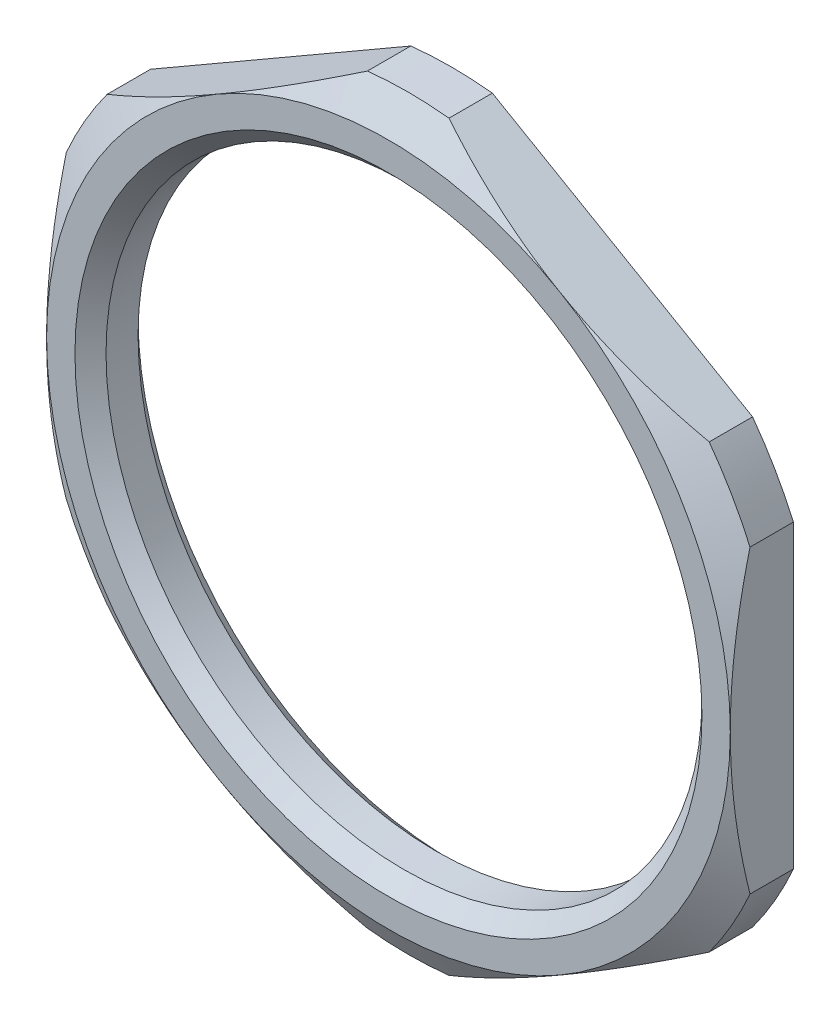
ISO-10303-21;
HEADER;
FILE_DESCRIPTION(('STEP AP214'),'2;1');
FILE_NAME('part.step','',(''),(''),'','','');
FILE_SCHEMA(('AUTOMOTIVE_DESIGN { 1 0 10303 214 1 1 1 1 }'));
ENDSEC;
DATA;
#1=APPLICATION_CONTEXT('core data for automotive mechanical design processes');
#2=APPLICATION_PROTOCOL_DEFINITION('international standard','automotive_design',2000,#1);
#3=PRODUCT_CONTEXT('',#1,'mechanical');
#4=PRODUCT('Part','Part','',(#3));
#5=PRODUCT_RELATED_PRODUCT_CATEGORY('part','',(#4));
#6=PRODUCT_DEFINITION_FORMATION('','',#4);
#7=PRODUCT_DEFINITION_CONTEXT('part definition',#1,'design');
#8=PRODUCT_DEFINITION('design','',#6,#7);
#9=PRODUCT_DEFINITION_SHAPE('','',#8);
#10=(LENGTH_UNIT() NAMED_UNIT(*) SI_UNIT(.MILLI.,.METRE.));
#11=(NAMED_UNIT(*) PLANE_ANGLE_UNIT() SI_UNIT($,.RADIAN.));
#12=(NAMED_UNIT(*) SI_UNIT($,.STERADIAN.) SOLID_ANGLE_UNIT());
#13=UNCERTAINTY_MEASURE_WITH_UNIT(LENGTH_MEASURE(1.E-05),#10,'distance_accuracy_value','');
#14=(GEOMETRIC_REPRESENTATION_CONTEXT(3) GLOBAL_UNCERTAINTY_ASSIGNED_CONTEXT((#13)) GLOBAL_UNIT_ASSIGNED_CONTEXT((#10,
#11,#12)) REPRESENTATION_CONTEXT('',''));
#15=CARTESIAN_POINT('',(0.,0.,0.));
#16=DIRECTION('',(0.,0.,1.));
#17=DIRECTION('',(1.,0.,0.));
#18=AXIS2_PLACEMENT_3D('',#15,#16,#17);
#19=CARTESIAN_POINT('',(0.,29.805,0.));
#20=DIRECTION('',(0.,0.,-1.));
#21=DIRECTION('',(-1.,0.,0.));
#22=AXIS2_PLACEMENT_3D('',#19,#20,#21);
#23=PLANE('',#22);
#24=DIRECTION('',(-0.866025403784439,-0.5,0.));
#25=VECTOR('',#24,1.);
#26=CARTESIAN_POINT('',(-3.3440564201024,35.5970756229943,0.));
#27=LINE('',#26,#25);
#28=CARTESIAN_POINT('',(-3.88068312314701,35.2872540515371,0.));
#29=VERTEX_POINT('',#28);
#30=CARTESIAN_POINT('',(-28.619316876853,21.0043971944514,0.));
#31=VERTEX_POINT('',#30);
#32=EDGE_CURVE('E389',#29,#31,#27,.T.);
#33=ORIENTED_EDGE('',*,*,#32,.F.);
#34=CARTESIAN_POINT('',(0.,9.29811783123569E-13,0.));
#35=DIRECTION('',(0.,0.,-1.));
#36=DIRECTION('',(-1.,0.,0.));
#37=AXIS2_PLACEMENT_3D('',#34,#35,#36);
#38=CIRCLE('',#37,35.4999999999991);
#39=CARTESIAN_POINT('',(3.88068312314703,35.2872540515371,0.));
#40=VERTEX_POINT('',#39);
#41=EDGE_CURVE('E391',#40,#29,#38,.F.);
#42=ORIENTED_EDGE('',*,*,#41,.F.);
#43=DIRECTION('',(-0.866025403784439,0.5,0.));
#44=VECTOR('',#43,1.);
#45=CARTESIAN_POINT('',(3.34405642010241,35.5970756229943,0.));
#46=LINE('',#45,#44);
#47=CARTESIAN_POINT('',(28.619316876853,21.0043971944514,0.));
#48=VERTEX_POINT('',#47);
#49=EDGE_CURVE('E147',#48,#40,#46,.T.);
#50=ORIENTED_EDGE('',*,*,#49,.F.);
#51=CARTESIAN_POINT('',(1.3010426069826E-12,7.45931094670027E-13,0.));
#52=DIRECTION('',(0.,0.,-1.));
#53=DIRECTION('',(-1.,0.,0.));
#54=AXIS2_PLACEMENT_3D('',#51,#52,#53);
#55=CIRCLE('',#54,35.4999999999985);
#56=CARTESIAN_POINT('',(32.5,14.2828568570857,-1.13473143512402E-13));
#57=VERTEX_POINT('',#56);
#58=EDGE_CURVE('E140',#57,#48,#55,.F.);
#59=ORIENTED_EDGE('',*,*,#58,.F.);
#60=DIRECTION('',(0.,1.,0.));
#61=VECTOR('',#60,1.);
#62=CARTESIAN_POINT('',(32.5,29.805,-1.13473143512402E-13));
#63=LINE('',#62,#61);
#64=CARTESIAN_POINT('',(32.5,-14.2828568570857,-1.13473143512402E-13));
#65=VERTEX_POINT('',#64);
#66=EDGE_CURVE('E130',#65,#57,#63,.T.);
#67=ORIENTED_EDGE('',*,*,#66,.F.);
#68=CARTESIAN_POINT('',(2.91433543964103E-13,-1.7347234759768E-13,0.));
#69=DIRECTION('',(0.,0.,-1.));
#70=DIRECTION('',(-1.,0.,0.));
#71=AXIS2_PLACEMENT_3D('',#68,#69,#70);
#72=CIRCLE('',#71,35.5);
#73=CARTESIAN_POINT('',(28.619316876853,-21.0043971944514,0.));
#74=VERTEX_POINT('',#73);
#75=EDGE_CURVE('E119',#74,#65,#72,.F.);
#76=ORIENTED_EDGE('',*,*,#75,.F.);
#77=DIRECTION('',(0.866025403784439,0.5,0.));
#78=VECTOR('',#77,1.);
#79=CARTESIAN_POINT('',(29.1559435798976,-20.6945756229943,-1.01797432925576E-13));
#80=LINE('',#79,#78);
#81=CARTESIAN_POINT('',(3.88068312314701,-35.2872540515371,0.));
#82=VERTEX_POINT('',#81);
#83=EDGE_CURVE('E124',#82,#74,#80,.T.);
#84=ORIENTED_EDGE('',*,*,#83,.F.);
#85=CARTESIAN_POINT('',(0.,-3.19189119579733E-13,0.));
#86=DIRECTION('',(0.,0.,-1.));
#87=DIRECTION('',(-1.,0.,0.));
#88=AXIS2_PLACEMENT_3D('',#85,#86,#87);
#89=CIRCLE('',#88,35.5);
#90=CARTESIAN_POINT('',(-3.88068312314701,-35.2872540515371,0.));
#91=VERTEX_POINT('',#90);
#92=EDGE_CURVE('E379',#91,#82,#89,.F.);
#93=ORIENTED_EDGE('',*,*,#92,.F.);
#94=DIRECTION('',(0.866025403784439,-0.5,0.));
#95=VECTOR('',#94,1.);
#96=CARTESIAN_POINT('',(-29.1559435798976,-20.6945756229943,1.01797432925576E-13));
#97=LINE('',#96,#95);
#98=CARTESIAN_POINT('',(-28.619316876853,-21.0043971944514,0.));
#99=VERTEX_POINT('',#98);
#100=EDGE_CURVE('E381',#99,#91,#97,.T.);
#101=ORIENTED_EDGE('',*,*,#100,.F.);
#102=CARTESIAN_POINT('',(8.11850586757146E-13,4.68375338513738E-13,0.));
#103=DIRECTION('',(0.,0.,-1.));
#104=DIRECTION('',(-1.,0.,0.));
#105=AXIS2_PLACEMENT_3D('',#102,#103,#104);
#106=CIRCLE('',#105,35.5000000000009);
#107=CARTESIAN_POINT('',(-32.5,-14.2828568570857,1.13473143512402E-13));
#108=VERTEX_POINT('',#107);
#109=EDGE_CURVE('E383',#108,#99,#106,.F.);
#110=ORIENTED_EDGE('',*,*,#109,.F.);
#111=DIRECTION('',(0.,-1.,0.));
#112=VECTOR('',#111,1.);
#113=CARTESIAN_POINT('',(-32.5,29.805,1.13473143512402E-13));
#114=LINE('',#113,#112);
#115=CARTESIAN_POINT('',(-32.5,14.2828568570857,1.13473143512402E-13));
#116=VERTEX_POINT('',#115);
#117=EDGE_CURVE('E385',#116,#108,#114,.T.);
#118=ORIENTED_EDGE('',*,*,#117,.F.);
#119=CARTESIAN_POINT('',(0.,0.,0.));
#120=DIRECTION('',(0.,0.,-1.));
#121=DIRECTION('',(-1.,0.,0.));
#122=AXIS2_PLACEMENT_3D('',#119,#120,#121);
#123=CIRCLE('',#122,35.5);
#124=EDGE_CURVE('E387',#31,#116,#123,.F.);
#125=ORIENTED_EDGE('',*,*,#124,.F.);
#126=EDGE_LOOP('',(#33,#42,#50,#59,#67,#76,#84,#93,#101,#110,#118,#125));
#127=FACE_BOUND('',#126,.T.);
#128=CARTESIAN_POINT('',(0.,0.,0.));
#129=DIRECTION('',(0.,0.,-1.));
#130=DIRECTION('',(-1.,0.,0.));
#131=AXIS2_PLACEMENT_3D('',#128,#129,#130);
#132=CIRCLE('',#131,29.805);
#133=CARTESIAN_POINT('',(-29.805,0.,1.0406360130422E-13));
#134=VERTEX_POINT('',#133);
#135=EDGE_CURVE('E152',#134,#134,#132,.T.);
#136=ORIENTED_EDGE('',*,*,#135,.F.);
#137=EDGE_LOOP('',(#136));
#138=FACE_BOUND('',#137,.T.);
#139=ADVANCED_FACE('F14',(#127,#138),#23,.T.);
#140=CARTESIAN_POINT('',(0.,0.,0.));
#141=DIRECTION('',(0.,0.,-1.));
#142=DIRECTION('',(-1.,0.,0.));
#143=AXIS2_PLACEMENT_3D('',#140,#141,#142);
#144=CONICAL_SURFACE('',#143,42.1020071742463,1.01229096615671);
#145=CARTESIAN_POINT('',(0.,0.,4.12539194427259));
#146=DIRECTION('',(0.,0.,-1.));
#147=DIRECTION('',(-1.,0.,0.));
#148=AXIS2_PLACEMENT_3D('',#145,#146,#147);
#149=CIRCLE('',#148,35.4999999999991);
#150=CARTESIAN_POINT('',(-3.880683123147,35.2872540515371,4.12539194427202));
#151=VERTEX_POINT('',#150);
#152=CARTESIAN_POINT('',(3.88068312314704,35.2872540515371,4.12539194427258));
#153=VERTEX_POINT('',#152);
#154=EDGE_CURVE('E18',#151,#153,#149,.T.);
#155=ORIENTED_EDGE('',*,*,#154,.F.);
#156=CARTESIAN_POINT('',(-28.619516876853,21.0042817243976,4.12533388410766));
#157=CARTESIAN_POINT('',(-27.9278554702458,21.4036126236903,4.32615335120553));
#158=CARTESIAN_POINT('',(-27.2331969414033,21.8046739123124,4.51367629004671));
#159=CARTESIAN_POINT('',(-25.8381436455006,22.6101083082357,4.85916322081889));
#160=CARTESIAN_POINT('',(-25.1377469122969,23.0144825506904,5.01711659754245));
#161=CARTESIAN_POINT('',(-23.7311787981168,23.8265650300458,5.30050999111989));
#162=CARTESIAN_POINT('',(-23.0250017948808,24.2342765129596,5.42591313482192));
#163=CARTESIAN_POINT('',(-21.6086649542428,25.0519989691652,5.64124098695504));
#164=CARTESIAN_POINT('',(-20.8985056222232,25.4620096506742,5.73117009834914));
#165=CARTESIAN_POINT('',(-19.4909667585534,26.2746525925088,5.87185625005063));
#166=CARTESIAN_POINT('',(-18.793648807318,26.6772492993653,5.92342967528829));
#167=CARTESIAN_POINT('',(-17.397650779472,27.4832291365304,5.98933807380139));
#168=CARTESIAN_POINT('',(-16.6989706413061,27.886612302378,6.00367132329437));
#169=CARTESIAN_POINT('',(-15.3023942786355,28.6929260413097,5.99473521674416));
#170=CARTESIAN_POINT('',(-14.6044978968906,29.0958567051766,5.97149820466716));
#171=CARTESIAN_POINT('',(-13.2104390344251,29.9007169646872,5.88807003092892));
#172=CARTESIAN_POINT('',(-12.5142763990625,30.3026466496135,5.82788229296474));
#173=CARTESIAN_POINT('',(-11.1538261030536,31.0881029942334,5.6752510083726));
#174=CARTESIAN_POINT('',(-10.4894157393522,31.4717004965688,5.58425137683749));
#175=CARTESIAN_POINT('',(-9.1643020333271,32.2367552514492,5.37152766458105));
#176=CARTESIAN_POINT('',(-8.50359874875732,32.6182124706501,5.24980310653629));
#177=CARTESIAN_POINT('',(-7.17943871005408,33.3827166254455,4.97642159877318));
#178=CARTESIAN_POINT('',(-6.51603071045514,33.7657354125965,4.82445221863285));
#179=CARTESIAN_POINT('',(-5.1943495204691,34.5288084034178,4.49407539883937));
#180=CARTESIAN_POINT('',(-4.53607496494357,34.9088633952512,4.31567525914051));
#181=CARTESIAN_POINT('',(-3.88048312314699,35.2873695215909,4.12533388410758));
#182=B_SPLINE_CURVE_WITH_KNOTS('',3,(#156,#157,#158,#159,#160,#161,#162,#163,#164,#165,#166,
#167,#168,#169,#170,#171,#172,#173,#174,#175,#176,#177,#178,#179,#180,#181),.UNSPECIFIED.,.F.,
.F.,(4,2,2,2,2,2,2,2,2,2,2,2,4),(0.,2.47062282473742,4.94213088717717,7.41642659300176,
9.8904150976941,12.3101075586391,14.7299120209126,17.1476344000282,19.5651327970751,
21.8821985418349,24.1993002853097,26.5417119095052,28.8834777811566),.UNSPECIFIED.);
#183=CARTESIAN_POINT('',(-16.25,28.1458256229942,6.));
#184=VERTEX_POINT('',#183);
#185=EDGE_CURVE('E9',#184,#151,#182,.T.);
#186=ORIENTED_EDGE('',*,*,#185,.F.);
#187=CARTESIAN_POINT('',(0.,0.,6.));
#188=DIRECTION('',(0.,0.,-1.));
#189=DIRECTION('',(-1.,0.,0.));
#190=AXIS2_PLACEMENT_3D('',#187,#188,#189);
#191=CIRCLE('',#190,32.5);
#192=CARTESIAN_POINT('',(16.25,28.1458256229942,6.));
#193=VERTEX_POINT('',#192);
#194=EDGE_CURVE('E146',#184,#193,#191,.T.);
#195=ORIENTED_EDGE('',*,*,#194,.T.);
#196=CARTESIAN_POINT('',(3.88048312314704,35.2873695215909,4.12533388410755));
#197=CARTESIAN_POINT('',(4.57214452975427,34.8880386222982,4.32615335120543));
#198=CARTESIAN_POINT('',(5.26680305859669,34.4869773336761,4.51367629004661));
#199=CARTESIAN_POINT('',(6.6618563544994,33.6815429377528,4.8591632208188));
#200=CARTESIAN_POINT('',(7.36225308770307,33.2771686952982,5.01711659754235));
#201=CARTESIAN_POINT('',(8.76882120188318,32.4650862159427,5.3005099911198));
#202=CARTESIAN_POINT('',(9.47499820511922,32.0573747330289,5.42591313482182));
#203=CARTESIAN_POINT('',(10.8913350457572,31.2396522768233,5.64124098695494));
#204=CARTESIAN_POINT('',(11.6014943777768,30.8296415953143,5.73117009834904));
#205=CARTESIAN_POINT('',(13.0090332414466,30.0169986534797,5.87185625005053));
#206=CARTESIAN_POINT('',(13.706351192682,29.6144019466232,5.92342967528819));
#207=CARTESIAN_POINT('',(15.102349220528,28.8084221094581,5.98933807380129));
#208=CARTESIAN_POINT('',(15.8010293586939,28.4050389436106,6.00367132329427));
#209=CARTESIAN_POINT('',(17.1976057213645,27.5987252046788,5.99473521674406));
#210=CARTESIAN_POINT('',(17.8955021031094,27.1957945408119,5.97149820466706));
#211=CARTESIAN_POINT('',(19.2895609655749,26.3909342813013,5.88807003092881));
#212=CARTESIAN_POINT('',(19.9857236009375,25.989004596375,5.82788229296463));
#213=CARTESIAN_POINT('',(21.3461738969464,25.2035482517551,5.67525100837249));
#214=CARTESIAN_POINT('',(22.0105842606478,24.8199507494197,5.58425137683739));
#215=CARTESIAN_POINT('',(23.3356979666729,24.0548959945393,5.37152766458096));
#216=CARTESIAN_POINT('',(23.9964012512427,23.6734387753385,5.24980310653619));
#217=CARTESIAN_POINT('',(25.3205612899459,22.908934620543,4.97642159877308));
#218=CARTESIAN_POINT('',(25.9839692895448,22.525915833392,4.82445221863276));
#219=CARTESIAN_POINT('',(27.3056504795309,21.7628428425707,4.49407539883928));
#220=CARTESIAN_POINT('',(27.9639250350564,21.3827878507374,4.31567525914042));
#221=CARTESIAN_POINT('',(28.619516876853,21.0042817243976,4.12533388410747));
#222=B_SPLINE_CURVE_WITH_KNOTS('',3,(#196,#197,#198,#199,#200,#201,#202,#203,#204,#205,#206,
#207,#208,#209,#210,#211,#212,#213,#214,#215,#216,#217,#218,#219,#220,#221),.UNSPECIFIED.,.F.,
.F.,(4,2,2,2,2,2,2,2,2,2,2,2,4),(0.,2.47062282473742,4.94213088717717,7.41642659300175,
9.89041509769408,12.3101075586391,14.7299120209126,17.1476344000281,19.565132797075,
21.8821985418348,24.1993002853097,26.5417119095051,28.8834777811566),.UNSPECIFIED.);
#223=EDGE_CURVE('E252',#153,#193,#222,.T.);
#224=ORIENTED_EDGE('',*,*,#223,.F.);
#225=EDGE_LOOP('',(#155,#186,#195,#224));
#226=FACE_BOUND('',#225,.T.);
#227=ADVANCED_FACE('F199',(#226),#144,.T.);
#228=CARTESIAN_POINT('',(-28.619316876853,21.0043971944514,4.12539194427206));
#229=VERTEX_POINT('',#228);
#230=EDGE_CURVE('E23',#229,#184,#182,.T.);
#231=ORIENTED_EDGE('',*,*,#230,.F.);
#232=CARTESIAN_POINT('',(0.,0.,4.12539194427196));
#233=DIRECTION('',(0.,0.,-1.));
#234=DIRECTION('',(-1.,0.,0.));
#235=AXIS2_PLACEMENT_3D('',#232,#233,#234);
#236=CIRCLE('',#235,35.5);
#237=CARTESIAN_POINT('',(-32.5,14.2828568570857,4.12539194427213));
#238=VERTEX_POINT('',#237);
#239=EDGE_CURVE('E246',#238,#229,#236,.T.);
#240=ORIENTED_EDGE('',*,*,#239,.F.);
#241=CARTESIAN_POINT('',(-32.5,-43.4720958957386,-7.60824263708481));
#242=CARTESIAN_POINT('',(-32.5,-42.9179423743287,-7.33090970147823));
#243=CARTESIAN_POINT('',(-32.5,-42.3630320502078,-7.05509005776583));
#244=CARTESIAN_POINT('',(-32.5,-41.2515709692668,-6.50676263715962));
#245=CARTESIAN_POINT('',(-32.5,-40.6950201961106,-6.23425489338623));
#246=CARTESIAN_POINT('',(-32.5,-39.022599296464,-5.42207049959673));
#247=CARTESIAN_POINT('',(-32.5,-37.9040940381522,-4.88779964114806));
#248=CARTESIAN_POINT('',(-32.5,-35.6552825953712,-3.83476595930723));
#249=CARTESIAN_POINT('',(-32.5,-34.5249496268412,-3.31606022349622));
#250=CARTESIAN_POINT('',(-32.5,-32.2549221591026,-2.29959410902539));
#251=CARTESIAN_POINT('',(-32.5,-31.1152279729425,-1.80183303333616));
#252=CARTESIAN_POINT('',(-32.5,-28.7905019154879,-0.817055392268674));
#253=CARTESIAN_POINT('',(-32.5,-27.6051395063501,-0.330815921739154));
#254=CARTESIAN_POINT('',(-32.5,-25.2212686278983,0.608670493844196));
#255=CARTESIAN_POINT('',(-32.5,-24.0227594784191,1.06191572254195));
#256=CARTESIAN_POINT('',(-32.5,-21.6123589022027,1.92735953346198));
#257=CARTESIAN_POINT('',(-32.5,-20.4004829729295,2.33960102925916));
#258=CARTESIAN_POINT('',(-32.5,-17.9609399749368,3.11438274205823));
#259=CARTESIAN_POINT('',(-32.5,-16.7332751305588,3.47692987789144));
#260=CARTESIAN_POINT('',(-32.5,-14.6812770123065,4.02881335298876));
#261=CARTESIAN_POINT('',(-32.5,-13.8615157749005,4.23516711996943));
#262=CARTESIAN_POINT('',(-32.5,-12.2150639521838,4.61822853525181));
#263=CARTESIAN_POINT('',(-32.5,-11.3883735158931,4.79493681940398));
#264=CARTESIAN_POINT('',(-32.5,-9.72871386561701,5.11536729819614));
#265=CARTESIAN_POINT('',(-32.5,-8.89574560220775,5.25909438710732));
#266=CARTESIAN_POINT('',(-32.5,-7.22434837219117,5.51048901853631));
#267=CARTESIAN_POINT('',(-32.5,-6.38591943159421,5.61815673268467));
#268=CARTESIAN_POINT('',(-32.5,-4.71579761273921,5.79368711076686));
#269=CARTESIAN_POINT('',(-32.5,-3.88415712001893,5.86204474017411));
#270=CARTESIAN_POINT('',(-32.5,-2.21856908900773,5.95933129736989));
#271=CARTESIAN_POINT('',(-32.5,-1.38462159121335,5.98826091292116));
#272=CARTESIAN_POINT('',(-32.4999999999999,0.283671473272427,6.00591336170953));
#273=CARTESIAN_POINT('',(-32.4999999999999,1.11801702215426,5.99463785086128));
#274=CARTESIAN_POINT('',(-32.5,2.78521915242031,5.93219695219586));
#275=CARTESIAN_POINT('',(-32.5,3.61807567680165,5.88103006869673));
#276=CARTESIAN_POINT('',(-32.5,5.48179563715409,5.72305886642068));
#277=CARTESIAN_POINT('',(-32.5,6.5117790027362,5.60578346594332));
#278=CARTESIAN_POINT('',(-32.4999999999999,8.56394542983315,5.31607415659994));
#279=CARTESIAN_POINT('',(-32.5,9.5861277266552,5.14363490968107));
#280=CARTESIAN_POINT('',(-32.5,11.6215574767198,4.7491432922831));
#281=CARTESIAN_POINT('',(-32.5,12.6347979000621,4.5270549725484));
#282=CARTESIAN_POINT('',(-32.5,14.6506893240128,4.03949718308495));
#283=CARTESIAN_POINT('',(-32.5,15.6533404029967,3.77402803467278));
#284=CARTESIAN_POINT('',(-32.5,17.6613691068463,3.20190208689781));
#285=CARTESIAN_POINT('',(-32.5,18.6666013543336,2.89473840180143));
#286=CARTESIAN_POINT('',(-32.5,20.6664507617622,2.24777954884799));
#287=CARTESIAN_POINT('',(-32.5,21.6610678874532,1.90798427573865));
#288=CARTESIAN_POINT('',(-32.5,23.6400850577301,1.20090738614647));
#289=CARTESIAN_POINT('',(-32.5,24.6244882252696,0.833634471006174));
#290=CARTESIAN_POINT('',(-32.5,26.5842527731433,0.0757929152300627));
#291=CARTESIAN_POINT('',(-32.5,27.5596141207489,-0.31477580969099));
#292=CARTESIAN_POINT('',(-32.5,29.8112288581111,-1.24297636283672));
#293=CARTESIAN_POINT('',(-32.5,31.0844868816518,-1.78786360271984));
#294=CARTESIAN_POINT('',(-32.5,33.6188500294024,-2.90511432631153));
#295=CARTESIAN_POINT('',(-32.5,34.8799549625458,-3.47747824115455));
#296=CARTESIAN_POINT('',(-32.5,37.3676481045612,-4.63327206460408));
#297=CARTESIAN_POINT('',(-32.5,38.5944338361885,-5.21627778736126));
#298=CARTESIAN_POINT('',(-32.5,40.4281603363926,-6.10396186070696));
#299=CARTESIAN_POINT('',(-32.5,41.038308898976,-6.40204330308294));
#300=CARTESIAN_POINT('',(-32.5,42.2566395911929,-7.00222547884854));
#301=CARTESIAN_POINT('',(-32.5,42.8648216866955,-7.30432628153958));
#302=CARTESIAN_POINT('',(-32.5,43.4720958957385,-7.60824263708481));
#303=B_SPLINE_CURVE_WITH_KNOTS('',3,(#241,#242,#243,#244,#245,#246,#247,#248,#249,#250,#251,
#252,#253,#254,#255,#256,#257,#258,#259,#260,#261,#262,#263,#264,#265,#266,#267,#268,#269,#270,
#271,#272,#273,#274,#275,#276,#277,#278,#279,#280,#281,#282,#283,#284,#285,#286,#287,#288,#289,
#290,#291,#292,#293,#294,#295,#296,#297,#298,#299,#300,#301,#302),.UNSPECIFIED.,.F.,.F.,(4,2,2,
2,2,2,2,2,2,2,2,2,2,2,2,2,2,2,2,2,2,2,2,2,2,2,2,2,2,2,4),(0.,1.85902691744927,3.71807241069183,
7.43661127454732,11.1674394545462,14.8981433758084,18.7413895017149,22.584835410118,
26.4242155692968,30.263060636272,32.7985986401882,35.3340822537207,37.8691893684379,
40.404284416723,42.9067180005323,45.4091079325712,47.9113948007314,50.4137754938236,
53.5220046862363,56.6305347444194,59.741322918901,62.8520880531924,66.0047785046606,
69.1574791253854,72.3091855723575,75.4609034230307,79.6153270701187,83.7698159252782,
87.8444477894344,89.8816411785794,91.9188697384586),.UNSPECIFIED.);
#304=CARTESIAN_POINT('',(-32.5,0.,6.00000000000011));
#305=VERTEX_POINT('',#304);
#306=EDGE_CURVE('E248',#305,#238,#303,.T.);
#307=ORIENTED_EDGE('',*,*,#306,.F.);
#308=EDGE_CURVE('E141',#305,#184,#191,.T.);
#309=ORIENTED_EDGE('',*,*,#308,.T.);
#310=EDGE_LOOP('',(#231,#240,#307,#309));
#311=FACE_BOUND('',#310,.T.);
#312=ADVANCED_FACE('F204',(#311),#144,.T.);
#313=CARTESIAN_POINT('',(28.619316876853,21.0043971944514,4.12539194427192));
#314=VERTEX_POINT('',#313);
#315=EDGE_CURVE('E256',#193,#314,#222,.T.);
#316=ORIENTED_EDGE('',*,*,#315,.F.);
#317=CARTESIAN_POINT('',(32.5,0.,5.99999999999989));
#318=VERTEX_POINT('',#317);
#319=EDGE_CURVE('E153',#193,#318,#191,.T.);
#320=ORIENTED_EDGE('',*,*,#319,.T.);
#321=CARTESIAN_POINT('',(32.5,43.4720958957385,-7.60824263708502));
#322=CARTESIAN_POINT('',(32.5,42.9179423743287,-7.33090970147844));
#323=CARTESIAN_POINT('',(32.5,42.3630320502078,-7.05509005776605));
#324=CARTESIAN_POINT('',(32.5,41.2515709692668,-6.50676263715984));
#325=CARTESIAN_POINT('',(32.5,40.6950201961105,-6.23425489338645));
#326=CARTESIAN_POINT('',(32.5,39.022599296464,-5.42207049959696));
#327=CARTESIAN_POINT('',(32.5,37.9040940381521,-4.88779964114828));
#328=CARTESIAN_POINT('',(32.5,35.6552825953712,-3.83476595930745));
#329=CARTESIAN_POINT('',(32.5,34.5249496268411,-3.31606022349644));
#330=CARTESIAN_POINT('',(32.5,32.2549221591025,-2.29959410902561));
#331=CARTESIAN_POINT('',(32.5,31.1152279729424,-1.80183303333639));
#332=CARTESIAN_POINT('',(32.5,28.7905019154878,-0.817055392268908));
#333=CARTESIAN_POINT('',(32.5,27.60513950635,-0.330815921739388));
#334=CARTESIAN_POINT('',(32.5,25.2212686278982,0.608670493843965));
#335=CARTESIAN_POINT('',(32.5,24.022759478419,1.06191572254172));
#336=CARTESIAN_POINT('',(32.5,21.6123589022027,1.92735953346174));
#337=CARTESIAN_POINT('',(32.5,20.4004829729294,2.33960102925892));
#338=CARTESIAN_POINT('',(32.5,17.9609399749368,3.11438274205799));
#339=CARTESIAN_POINT('',(32.5,16.7332751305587,3.47692987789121));
#340=CARTESIAN_POINT('',(32.5,14.6812770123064,4.02881335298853));
#341=CARTESIAN_POINT('',(32.5,13.8615157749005,4.23516711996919));
#342=CARTESIAN_POINT('',(32.5,12.2150639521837,4.61822853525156));
#343=CARTESIAN_POINT('',(32.5,11.388373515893,4.79493681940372));
#344=CARTESIAN_POINT('',(32.5,9.72871386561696,5.11536729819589));
#345=CARTESIAN_POINT('',(32.5,8.8957456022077,5.25909438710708));
#346=CARTESIAN_POINT('',(32.5,7.22434837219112,5.51048901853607));
#347=CARTESIAN_POINT('',(32.5,6.38591943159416,5.61815673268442));
#348=CARTESIAN_POINT('',(32.5,4.71579761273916,5.7936871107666));
#349=CARTESIAN_POINT('',(32.5,3.88415712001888,5.86204474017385));
#350=CARTESIAN_POINT('',(32.5,2.21856908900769,5.95933129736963));
#351=CARTESIAN_POINT('',(32.5,1.38462159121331,5.9882609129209));
#352=CARTESIAN_POINT('',(32.5000000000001,-0.283671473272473,6.00591336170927));
#353=CARTESIAN_POINT('',(32.5000000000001,-1.11801702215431,5.99463785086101));
#354=CARTESIAN_POINT('',(32.5,-2.78521915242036,5.93219695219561));
#355=CARTESIAN_POINT('',(32.5,-3.6180756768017,5.8810300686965));
#356=CARTESIAN_POINT('',(32.5,-5.48179563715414,5.72305886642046));
#357=CARTESIAN_POINT('',(32.5,-6.51177900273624,5.60578346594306));
#358=CARTESIAN_POINT('',(32.5000000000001,-8.56394542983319,5.31607415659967));
#359=CARTESIAN_POINT('',(32.5,-9.58612772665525,5.1436349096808));
#360=CARTESIAN_POINT('',(32.5,-11.6215574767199,4.74914329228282));
#361=CARTESIAN_POINT('',(32.5,-12.6347979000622,4.52705497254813));
#362=CARTESIAN_POINT('',(32.5,-14.6506893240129,4.03949718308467));
#363=CARTESIAN_POINT('',(32.5,-15.6533404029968,3.77402803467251));
#364=CARTESIAN_POINT('',(32.5,-17.6613691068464,3.20190208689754));
#365=CARTESIAN_POINT('',(32.5,-18.6666013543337,2.89473840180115));
#366=CARTESIAN_POINT('',(32.5,-20.6664507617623,2.24777954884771));
#367=CARTESIAN_POINT('',(32.5,-21.6610678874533,1.90798427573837));
#368=CARTESIAN_POINT('',(32.5,-23.6400850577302,1.20090738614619));
#369=CARTESIAN_POINT('',(32.5,-24.6244882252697,0.833634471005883));
#370=CARTESIAN_POINT('',(32.5,-26.5842527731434,0.0757929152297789));
#371=CARTESIAN_POINT('',(32.5,-27.559614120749,-0.314775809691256));
#372=CARTESIAN_POINT('',(32.5,-29.8112288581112,-1.24297636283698));
#373=CARTESIAN_POINT('',(32.5,-31.0844868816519,-1.78786360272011));
#374=CARTESIAN_POINT('',(32.5,-33.6188500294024,-2.90511432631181));
#375=CARTESIAN_POINT('',(32.5,-34.8799549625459,-3.47747824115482));
#376=CARTESIAN_POINT('',(32.5,-37.3676481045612,-4.63327206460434));
#377=CARTESIAN_POINT('',(32.5,-38.5944338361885,-5.21627778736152));
#378=CARTESIAN_POINT('',(32.5,-40.4281603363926,-6.10396186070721));
#379=CARTESIAN_POINT('',(32.5,-41.038308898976,-6.40204330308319));
#380=CARTESIAN_POINT('',(32.5,-42.2566395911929,-7.00222547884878));
#381=CARTESIAN_POINT('',(32.5,-42.8648216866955,-7.3043262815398));
#382=CARTESIAN_POINT('',(32.5,-43.4720958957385,-7.60824263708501));
#383=B_SPLINE_CURVE_WITH_KNOTS('',3,(#321,#322,#323,#324,#325,#326,#327,#328,#329,#330,#331,
#332,#333,#334,#335,#336,#337,#338,#339,#340,#341,#342,#343,#344,#345,#346,#347,#348,#349,#350,
#351,#352,#353,#354,#355,#356,#357,#358,#359,#360,#361,#362,#363,#364,#365,#366,#367,#368,#369,
#370,#371,#372,#373,#374,#375,#376,#377,#378,#379,#380,#381,#382),.UNSPECIFIED.,.F.,.F.,(4,2,2,
2,2,2,2,2,2,2,2,2,2,2,2,2,2,2,2,2,2,2,2,2,2,2,2,2,2,2,4),(0.,1.85902691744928,3.71807241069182,
7.43661127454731,11.1674394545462,14.8981433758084,18.7413895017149,22.584835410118,
26.4242155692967,30.263060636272,32.7985986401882,35.3340822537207,37.8691893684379,
40.404284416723,42.9067180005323,45.4091079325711,47.9113948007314,50.4137754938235,
53.5220046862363,56.6305347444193,59.741322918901,62.8520880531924,66.0047785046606,
69.1574791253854,72.3091855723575,75.4609034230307,79.6153270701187,83.7698159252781,
87.8444477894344,89.8816411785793,91.9188697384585),.UNSPECIFIED.);
#384=CARTESIAN_POINT('',(32.5,14.2828568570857,4.12539194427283));
#385=VERTEX_POINT('',#384);
#386=EDGE_CURVE('E354',#385,#318,#383,.T.);
#387=ORIENTED_EDGE('',*,*,#386,.F.);
#388=CARTESIAN_POINT('',(0.,0.,4.12539194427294));
#389=DIRECTION('',(0.,0.,-1.));
#390=DIRECTION('',(-1.,0.,0.));
#391=AXIS2_PLACEMENT_3D('',#388,#389,#390);
#392=CIRCLE('',#391,35.4999999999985);
#393=EDGE_CURVE('E272',#314,#385,#392,.T.);
#394=ORIENTED_EDGE('',*,*,#393,.F.);
#395=EDGE_LOOP('',(#316,#320,#387,#394));
#396=FACE_BOUND('',#395,.T.);
#397=ADVANCED_FACE('F334',(#396),#144,.T.);
#398=CARTESIAN_POINT('',(-32.5,-14.2828568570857,4.12539194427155));
#399=VERTEX_POINT('',#398);
#400=EDGE_CURVE('E254',#399,#305,#303,.T.);
#401=ORIENTED_EDGE('',*,*,#400,.F.);
#402=CARTESIAN_POINT('',(0.,0.,4.12539194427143));
#403=DIRECTION('',(0.,0.,-1.));
#404=DIRECTION('',(-1.,0.,0.));
#405=AXIS2_PLACEMENT_3D('',#402,#403,#404);
#406=CIRCLE('',#405,35.5000000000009);
#407=CARTESIAN_POINT('',(-28.619316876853,-21.0043971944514,4.12539194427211));
#408=VERTEX_POINT('',#407);
#409=EDGE_CURVE('E264',#408,#399,#406,.T.);
#410=ORIENTED_EDGE('',*,*,#409,.F.);
#411=CARTESIAN_POINT('',(-3.88048312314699,-35.2873695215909,4.12533388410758));
#412=CARTESIAN_POINT('',(-4.57214452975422,-34.8880386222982,4.32615335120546));
#413=CARTESIAN_POINT('',(-5.26680305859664,-34.4869773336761,4.51367629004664));
#414=CARTESIAN_POINT('',(-6.66185635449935,-33.6815429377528,4.85916322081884));
#415=CARTESIAN_POINT('',(-7.36225308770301,-33.2771686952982,5.0171165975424));
#416=CARTESIAN_POINT('',(-8.76882120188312,-32.4650862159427,5.30050999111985));
#417=CARTESIAN_POINT('',(-9.47499820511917,-32.0573747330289,5.42591313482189));
#418=CARTESIAN_POINT('',(-10.8913350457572,-31.2396522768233,5.64124098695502));
#419=CARTESIAN_POINT('',(-11.6014943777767,-30.8296415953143,5.73117009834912));
#420=CARTESIAN_POINT('',(-13.0090332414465,-30.0169986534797,5.87185625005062));
#421=CARTESIAN_POINT('',(-13.7063511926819,-29.6144019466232,5.92342967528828));
#422=CARTESIAN_POINT('',(-15.102349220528,-28.8084221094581,5.98933807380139));
#423=CARTESIAN_POINT('',(-15.8010293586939,-28.4050389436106,6.00367132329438));
#424=CARTESIAN_POINT('',(-17.1976057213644,-27.5987252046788,5.99473521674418));
#425=CARTESIAN_POINT('',(-17.8955021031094,-27.1957945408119,5.97149820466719));
#426=CARTESIAN_POINT('',(-19.2895609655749,-26.3909342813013,5.88807003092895));
#427=CARTESIAN_POINT('',(-19.9857236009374,-25.989004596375,5.82788229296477));
#428=CARTESIAN_POINT('',(-21.3461738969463,-25.2035482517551,5.67525100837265));
#429=CARTESIAN_POINT('',(-22.0105842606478,-24.8199507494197,5.58425137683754));
#430=CARTESIAN_POINT('',(-23.3356979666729,-24.0548959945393,5.37152766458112));
#431=CARTESIAN_POINT('',(-23.9964012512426,-23.6734387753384,5.24980310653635));
#432=CARTESIAN_POINT('',(-25.3205612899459,-22.908934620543,4.97642159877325));
#433=CARTESIAN_POINT('',(-25.9839692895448,-22.525915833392,4.82445221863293));
#434=CARTESIAN_POINT('',(-27.3056504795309,-21.7628428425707,4.49407539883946));
#435=CARTESIAN_POINT('',(-27.9639250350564,-21.3827878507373,4.3156752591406));
#436=CARTESIAN_POINT('',(-28.619516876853,-21.0042817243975,4.12533388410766));
#437=B_SPLINE_CURVE_WITH_KNOTS('',3,(#411,#412,#413,#414,#415,#416,#417,#418,#419,#420,#421,
#422,#423,#424,#425,#426,#427,#428,#429,#430,#431,#432,#433,#434,#435,#436),.UNSPECIFIED.,.F.,
.F.,(4,2,2,2,2,2,2,2,2,2,2,2,4),(0.,2.47062282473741,4.94213088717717,7.41642659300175,
9.89041509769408,12.3101075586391,14.7299120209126,17.1476344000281,19.565132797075,
21.8821985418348,24.1993002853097,26.5417119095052,28.8834777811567),.UNSPECIFIED.);
#438=CARTESIAN_POINT('',(-16.25,-28.1458256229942,6.));
#439=VERTEX_POINT('',#438);
#440=EDGE_CURVE('E267',#439,#408,#437,.T.);
#441=ORIENTED_EDGE('',*,*,#440,.F.);
#442=EDGE_CURVE('E144',#439,#305,#191,.T.);
#443=ORIENTED_EDGE('',*,*,#442,.T.);
#444=EDGE_LOOP('',(#401,#410,#441,#443));
#445=FACE_BOUND('',#444,.T.);
#446=ADVANCED_FACE('F328',(#445),#144,.T.);
#447=CARTESIAN_POINT('',(-3.880683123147,-35.2872540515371,4.12539194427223));
#448=VERTEX_POINT('',#447);
#449=EDGE_CURVE('E274',#448,#439,#437,.T.);
#450=ORIENTED_EDGE('',*,*,#449,.F.);
#451=CARTESIAN_POINT('',(0.,0.,4.12539194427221));
#452=DIRECTION('',(0.,0.,-1.));
#453=DIRECTION('',(-1.,0.,0.));
#454=AXIS2_PLACEMENT_3D('',#451,#452,#453);
#455=CIRCLE('',#454,35.5);
#456=CARTESIAN_POINT('',(3.88068312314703,-35.2872540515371,4.12539194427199));
#457=VERTEX_POINT('',#456);
#458=EDGE_CURVE('E280',#457,#448,#455,.T.);
#459=ORIENTED_EDGE('',*,*,#458,.F.);
#460=CARTESIAN_POINT('',(28.619516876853,-21.0042817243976,4.12533388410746));
#461=CARTESIAN_POINT('',(27.9278554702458,-21.4036126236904,4.32615335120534));
#462=CARTESIAN_POINT('',(27.2331969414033,-21.8046739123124,4.51367629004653));
#463=CARTESIAN_POINT('',(25.8381436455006,-22.6101083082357,4.85916322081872));
#464=CARTESIAN_POINT('',(25.137746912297,-23.0144825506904,5.01711659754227));
#465=CARTESIAN_POINT('',(23.7311787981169,-23.8265650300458,5.30050999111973));
#466=CARTESIAN_POINT('',(23.0250017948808,-24.2342765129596,5.42591313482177));
#467=CARTESIAN_POINT('',(21.6086649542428,-25.0519989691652,5.6412409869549));
#468=CARTESIAN_POINT('',(20.8985056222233,-25.4620096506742,5.731170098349));
#469=CARTESIAN_POINT('',(19.4909667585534,-26.2746525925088,5.8718562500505));
#470=CARTESIAN_POINT('',(18.7936488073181,-26.6772492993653,5.92342967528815));
#471=CARTESIAN_POINT('',(17.397650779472,-27.4832291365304,5.98933807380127));
#472=CARTESIAN_POINT('',(16.6989706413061,-27.886612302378,6.00367132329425));
#473=CARTESIAN_POINT('',(15.3023942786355,-28.6929260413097,5.99473521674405));
#474=CARTESIAN_POINT('',(14.6044978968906,-29.0958567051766,5.97149820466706));
#475=CARTESIAN_POINT('',(13.2104390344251,-29.9007169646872,5.88807003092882));
#476=CARTESIAN_POINT('',(12.5142763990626,-30.3026466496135,5.82788229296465));
#477=CARTESIAN_POINT('',(11.1538261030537,-31.0881029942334,5.67525100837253));
#478=CARTESIAN_POINT('',(10.4894157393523,-31.4717004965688,5.58425137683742));
#479=CARTESIAN_POINT('',(9.16430203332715,-32.2367552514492,5.37152766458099));
#480=CARTESIAN_POINT('',(8.50359874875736,-32.6182124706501,5.24980310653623));
#481=CARTESIAN_POINT('',(7.17943871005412,-33.3827166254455,4.97642159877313));
#482=CARTESIAN_POINT('',(6.51603071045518,-33.7657354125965,4.82445221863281));
#483=CARTESIAN_POINT('',(5.19434952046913,-34.5288084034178,4.49407539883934));
#484=CARTESIAN_POINT('',(4.53607496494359,-34.9088633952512,4.31567525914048));
#485=CARTESIAN_POINT('',(3.88048312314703,-35.2873695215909,4.12533388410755));
#486=B_SPLINE_CURVE_WITH_KNOTS('',3,(#460,#461,#462,#463,#464,#465,#466,#467,#468,#469,#470,
#471,#472,#473,#474,#475,#476,#477,#478,#479,#480,#481,#482,#483,#484,#485),.UNSPECIFIED.,.F.,
.F.,(4,2,2,2,2,2,2,2,2,2,2,2,4),(0.,2.47062282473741,4.94213088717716,7.41642659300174,
9.89041509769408,12.310107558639,14.7299120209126,17.1476344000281,19.565132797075,
21.8821985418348,24.1993002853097,26.5417119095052,28.8834777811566),.UNSPECIFIED.);
#487=CARTESIAN_POINT('',(16.25,-28.1458256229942,6.));
#488=VERTEX_POINT('',#487);
#489=EDGE_CURVE('E175',#488,#457,#486,.T.);
#490=ORIENTED_EDGE('',*,*,#489,.F.);
#491=EDGE_CURVE('E341',#488,#439,#191,.T.);
#492=ORIENTED_EDGE('',*,*,#491,.T.);
#493=EDGE_LOOP('',(#450,#459,#490,#492));
#494=FACE_BOUND('',#493,.T.);
#495=ADVANCED_FACE('F221',(#494),#144,.T.);
#496=CARTESIAN_POINT('',(0.,32.5,6.));
#497=DIRECTION('',(0.,0.,1.));
#498=DIRECTION('',(1.,0.,0.));
#499=AXIS2_PLACEMENT_3D('',#496,#497,#498);
#500=PLANE('',#499);
#501=CARTESIAN_POINT('',(0.,0.,6.));
#502=DIRECTION('',(0.,0.,-1.));
#503=DIRECTION('',(-1.,0.,0.));
#504=AXIS2_PLACEMENT_3D('',#501,#502,#503);
#505=CIRCLE('',#504,29.805);
#506=CARTESIAN_POINT('',(-29.805,0.,6.0000000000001));
#507=VERTEX_POINT('',#506);
#508=EDGE_CURVE('E162',#507,#507,#505,.T.);
#509=ORIENTED_EDGE('',*,*,#508,.T.);
#510=EDGE_LOOP('',(#509));
#511=FACE_BOUND('',#510,.T.);
#512=ORIENTED_EDGE('',*,*,#194,.F.);
#513=ORIENTED_EDGE('',*,*,#308,.F.);
#514=ORIENTED_EDGE('',*,*,#442,.F.);
#515=ORIENTED_EDGE('',*,*,#491,.F.);
#516=EDGE_CURVE('E348',#318,#488,#191,.T.);
#517=ORIENTED_EDGE('',*,*,#516,.F.);
#518=ORIENTED_EDGE('',*,*,#319,.F.);
#519=EDGE_LOOP('',(#512,#513,#514,#515,#517,#518));
#520=FACE_BOUND('',#519,.T.);
#521=ADVANCED_FACE('F16',(#511,#520),#500,.T.);
#522=CARTESIAN_POINT('',(0.,0.,6.));
#523=DIRECTION('',(0.,0.,1.));
#524=DIRECTION('',(1.,0.,0.));
#525=AXIS2_PLACEMENT_3D('',#522,#523,#524);
#526=CONICAL_SURFACE('',#525,29.805,0.785398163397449);
#527=CARTESIAN_POINT('',(0.,0.,4.523));
#528=DIRECTION('',(0.,0.,-1.));
#529=DIRECTION('',(-1.,0.,0.));
#530=AXIS2_PLACEMENT_3D('',#527,#528,#529);
#531=CIRCLE('',#530,28.328);
#532=CARTESIAN_POINT('',(-28.328,0.,4.5230000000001));
#533=VERTEX_POINT('',#532);
#534=EDGE_CURVE('E159',#533,#533,#531,.T.);
#535=ORIENTED_EDGE('',*,*,#534,.T.);
#536=EDGE_LOOP('',(#535));
#537=FACE_BOUND('',#536,.T.);
#538=ORIENTED_EDGE('',*,*,#508,.F.);
#539=EDGE_LOOP('',(#538));
#540=FACE_BOUND('',#539,.T.);
#541=ADVANCED_FACE('F213',(#537,#540),#526,.F.);
#542=CARTESIAN_POINT('',(0.,0.,0.));
#543=DIRECTION('',(0.,0.,-1.));
#544=DIRECTION('',(-1.,0.,0.));
#545=AXIS2_PLACEMENT_3D('',#542,#543,#544);
#546=CYLINDRICAL_SURFACE('',#545,28.328);
#547=CARTESIAN_POINT('',(0.,0.,1.477));
#548=DIRECTION('',(0.,0.,-1.));
#549=DIRECTION('',(-1.,0.,0.));
#550=AXIS2_PLACEMENT_3D('',#547,#548,#549);
#551=CIRCLE('',#550,28.328);
#552=CARTESIAN_POINT('',(-28.328,0.,1.4770000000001));
#553=VERTEX_POINT('',#552);
#554=EDGE_CURVE('E156',#553,#553,#551,.T.);
#555=ORIENTED_EDGE('',*,*,#554,.T.);
#556=EDGE_LOOP('',(#555));
#557=FACE_BOUND('',#556,.T.);
#558=ORIENTED_EDGE('',*,*,#534,.F.);
#559=EDGE_LOOP('',(#558));
#560=FACE_BOUND('',#559,.T.);
#561=ADVANCED_FACE('F210',(#557,#560),#546,.F.);
#562=CARTESIAN_POINT('',(0.,0.,1.477));
#563=DIRECTION('',(0.,0.,-1.));
#564=DIRECTION('',(-1.,0.,0.));
#565=AXIS2_PLACEMENT_3D('',#562,#563,#564);
#566=CONICAL_SURFACE('',#565,28.328,0.785398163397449);
#567=ORIENTED_EDGE('',*,*,#135,.T.);
#568=EDGE_LOOP('',(#567));
#569=FACE_BOUND('',#568,.T.);
#570=ORIENTED_EDGE('',*,*,#554,.F.);
#571=EDGE_LOOP('',(#570));
#572=FACE_BOUND('',#571,.T.);
#573=ADVANCED_FACE('F207',(#569,#572),#566,.F.);
#574=CARTESIAN_POINT('',(32.5,-14.2828568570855,4.12539194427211));
#575=VERTEX_POINT('',#574);
#576=EDGE_CURVE('E133',#318,#575,#383,.T.);
#577=ORIENTED_EDGE('',*,*,#576,.F.);
#578=ORIENTED_EDGE('',*,*,#516,.T.);
#579=CARTESIAN_POINT('',(28.619316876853,-21.0043971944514,4.12539194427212));
#580=VERTEX_POINT('',#579);
#581=EDGE_CURVE('E167',#580,#488,#486,.T.);
#582=ORIENTED_EDGE('',*,*,#581,.F.);
#583=CARTESIAN_POINT('',(0.,0.,4.12539194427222));
#584=DIRECTION('',(0.,0.,-1.));
#585=DIRECTION('',(-1.,0.,0.));
#586=AXIS2_PLACEMENT_3D('',#583,#584,#585);
#587=CIRCLE('',#586,35.5);
#588=EDGE_CURVE('E165',#575,#580,#587,.T.);
#589=ORIENTED_EDGE('',*,*,#588,.F.);
#590=EDGE_LOOP('',(#577,#578,#582,#589));
#591=FACE_BOUND('',#590,.T.);
#592=ADVANCED_FACE('F182',(#591),#144,.T.);
#593=CARTESIAN_POINT('',(32.5,14.2828568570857,-7.00000000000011));
#594=DIRECTION('',(-1.,0.,0.));
#595=DIRECTION('',(0.,0.,1.));
#596=AXIS2_PLACEMENT_3D('',#593,#594,#595);
#597=PLANE('',#596);
#598=ORIENTED_EDGE('',*,*,#66,.T.);
#599=DIRECTION('',(0.,0.,1.));
#600=VECTOR('',#599,1.);
#601=CARTESIAN_POINT('',(32.5,14.2828568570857,-7.00000000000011));
#602=LINE('',#601,#600);
#603=EDGE_CURVE('E125',#57,#385,#602,.T.);
#604=ORIENTED_EDGE('',*,*,#603,.T.);
#605=ORIENTED_EDGE('',*,*,#386,.T.);
#606=ORIENTED_EDGE('',*,*,#576,.T.);
#607=DIRECTION('',(0.,0.,1.));
#608=VECTOR('',#607,1.);
#609=CARTESIAN_POINT('',(32.5,-14.2828568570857,-7.00000000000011));
#610=LINE('',#609,#608);
#611=EDGE_CURVE('E35',#65,#575,#610,.T.);
#612=ORIENTED_EDGE('',*,*,#611,.F.);
#613=EDGE_LOOP('',(#598,#604,#605,#606,#612));
#614=FACE_BOUND('',#613,.T.);
#615=ADVANCED_FACE('F128',(#614),#597,.F.);
#616=CARTESIAN_POINT('',(1.2766022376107E-12,7.45931094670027E-13,-7.));
#617=DIRECTION('',(0.,0.,1.));
#618=DIRECTION('',(1.,0.,0.));
#619=AXIS2_PLACEMENT_3D('',#616,#617,#618);
#620=CYLINDRICAL_SURFACE('',#619,35.4999999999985);
#621=ORIENTED_EDGE('',*,*,#58,.T.);
#622=DIRECTION('',(0.,0.,1.));
#623=VECTOR('',#622,1.);
#624=CARTESIAN_POINT('',(28.619316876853,21.0043971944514,-7.0000000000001));
#625=LINE('',#624,#623);
#626=EDGE_CURVE('E357',#48,#314,#625,.T.);
#627=ORIENTED_EDGE('',*,*,#626,.T.);
#628=ORIENTED_EDGE('',*,*,#393,.T.);
#629=ORIENTED_EDGE('',*,*,#603,.F.);
#630=EDGE_LOOP('',(#621,#627,#628,#629));
#631=FACE_BOUND('',#630,.T.);
#632=ADVANCED_FACE('F313',(#631),#620,.T.);
#633=CARTESIAN_POINT('',(3.880683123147,35.2872540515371,-7.));
#634=DIRECTION('',(-0.5,-0.866025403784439,0.));
#635=DIRECTION('',(-0.866025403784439,0.5,0.));
#636=AXIS2_PLACEMENT_3D('',#633,#634,#635);
#637=PLANE('',#636);
#638=ORIENTED_EDGE('',*,*,#49,.T.);
#639=DIRECTION('',(0.,0.,1.));
#640=VECTOR('',#639,1.);
#641=CARTESIAN_POINT('',(3.880683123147,35.2872540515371,-7.));
#642=LINE('',#641,#640);
#643=EDGE_CURVE('E359',#40,#153,#642,.T.);
#644=ORIENTED_EDGE('',*,*,#643,.T.);
#645=ORIENTED_EDGE('',*,*,#223,.T.);
#646=ORIENTED_EDGE('',*,*,#315,.T.);
#647=ORIENTED_EDGE('',*,*,#626,.F.);
#648=EDGE_LOOP('',(#638,#644,#645,#646,#647));
#649=FACE_BOUND('',#648,.T.);
#650=ADVANCED_FACE('F309',(#649),#637,.F.);
#651=CARTESIAN_POINT('',(0.,9.29811783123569E-13,-7.));
#652=DIRECTION('',(0.,0.,1.));
#653=DIRECTION('',(1.,0.,0.));
#654=AXIS2_PLACEMENT_3D('',#651,#652,#653);
#655=CYLINDRICAL_SURFACE('',#654,35.4999999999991);
#656=ORIENTED_EDGE('',*,*,#41,.T.);
#657=DIRECTION('',(0.,0.,1.));
#658=VECTOR('',#657,1.);
#659=CARTESIAN_POINT('',(-3.88068312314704,35.2872540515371,-7.));
#660=LINE('',#659,#658);
#661=EDGE_CURVE('E362',#29,#151,#660,.T.);
#662=ORIENTED_EDGE('',*,*,#661,.T.);
#663=ORIENTED_EDGE('',*,*,#154,.T.);
#664=ORIENTED_EDGE('',*,*,#643,.F.);
#665=EDGE_LOOP('',(#656,#662,#663,#664));
#666=FACE_BOUND('',#665,.T.);
#667=ADVANCED_FACE('F299',(#666),#655,.T.);
#668=CARTESIAN_POINT('',(-28.6193168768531,21.0043971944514,-6.9999999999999));
#669=DIRECTION('',(0.5,-0.866025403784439,0.));
#670=DIRECTION('',(-0.866025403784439,-0.5,0.));
#671=AXIS2_PLACEMENT_3D('',#668,#669,#670);
#672=PLANE('',#671);
#673=ORIENTED_EDGE('',*,*,#32,.T.);
#674=DIRECTION('',(0.,0.,1.));
#675=VECTOR('',#674,1.);
#676=CARTESIAN_POINT('',(-28.6193168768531,21.0043971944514,-6.9999999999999));
#677=LINE('',#676,#675);
#678=EDGE_CURVE('E243',#31,#229,#677,.T.);
#679=ORIENTED_EDGE('',*,*,#678,.T.);
#680=ORIENTED_EDGE('',*,*,#230,.T.);
#681=ORIENTED_EDGE('',*,*,#185,.T.);
#682=ORIENTED_EDGE('',*,*,#661,.F.);
#683=EDGE_LOOP('',(#673,#679,#680,#681,#682));
#684=FACE_BOUND('',#683,.T.);
#685=ADVANCED_FACE('F239',(#684),#672,.F.);
#686=CARTESIAN_POINT('',(0.,0.,-7.));
#687=DIRECTION('',(0.,0.,1.));
#688=DIRECTION('',(1.,0.,0.));
#689=AXIS2_PLACEMENT_3D('',#686,#687,#688);
#690=CYLINDRICAL_SURFACE('',#689,35.5);
#691=ORIENTED_EDGE('',*,*,#124,.T.);
#692=DIRECTION('',(0.,0.,1.));
#693=VECTOR('',#692,1.);
#694=CARTESIAN_POINT('',(-32.5,14.2828568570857,-6.99999999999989));
#695=LINE('',#694,#693);
#696=EDGE_CURVE('E367',#116,#238,#695,.T.);
#697=ORIENTED_EDGE('',*,*,#696,.T.);
#698=ORIENTED_EDGE('',*,*,#239,.T.);
#699=ORIENTED_EDGE('',*,*,#678,.F.);
#700=EDGE_LOOP('',(#691,#697,#698,#699));
#701=FACE_BOUND('',#700,.T.);
#702=ADVANCED_FACE('F292',(#701),#690,.T.);
#703=CARTESIAN_POINT('',(-32.5,-14.2828568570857,-6.99999999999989));
#704=DIRECTION('',(1.,0.,0.));
#705=DIRECTION('',(0.,0.,-1.));
#706=AXIS2_PLACEMENT_3D('',#703,#704,#705);
#707=PLANE('',#706);
#708=ORIENTED_EDGE('',*,*,#117,.T.);
#709=DIRECTION('',(0.,0.,1.));
#710=VECTOR('',#709,1.);
#711=CARTESIAN_POINT('',(-32.5,-14.2828568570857,-6.99999999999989));
#712=LINE('',#711,#710);
#713=EDGE_CURVE('E369',#108,#399,#712,.T.);
#714=ORIENTED_EDGE('',*,*,#713,.T.);
#715=ORIENTED_EDGE('',*,*,#400,.T.);
#716=ORIENTED_EDGE('',*,*,#306,.T.);
#717=ORIENTED_EDGE('',*,*,#696,.F.);
#718=EDGE_LOOP('',(#708,#714,#715,#716,#717));
#719=FACE_BOUND('',#718,.T.);
#720=ADVANCED_FACE('F288',(#719),#707,.F.);
#721=CARTESIAN_POINT('',(7.87410217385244E-13,4.68375338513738E-13,-7.));
#722=DIRECTION('',(0.,0.,1.));
#723=DIRECTION('',(1.,0.,0.));
#724=AXIS2_PLACEMENT_3D('',#721,#722,#723);
#725=CYLINDRICAL_SURFACE('',#724,35.5000000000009);
#726=ORIENTED_EDGE('',*,*,#109,.T.);
#727=DIRECTION('',(0.,0.,1.));
#728=VECTOR('',#727,1.);
#729=CARTESIAN_POINT('',(-28.6193168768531,-21.0043971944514,-6.9999999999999));
#730=LINE('',#729,#728);
#731=EDGE_CURVE('E371',#99,#408,#730,.T.);
#732=ORIENTED_EDGE('',*,*,#731,.T.);
#733=ORIENTED_EDGE('',*,*,#409,.T.);
#734=ORIENTED_EDGE('',*,*,#713,.F.);
#735=EDGE_LOOP('',(#726,#732,#733,#734));
#736=FACE_BOUND('',#735,.T.);
#737=ADVANCED_FACE('F285',(#736),#725,.T.);
#738=CARTESIAN_POINT('',(-3.88068312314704,-35.2872540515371,-7.));
#739=DIRECTION('',(0.5,0.866025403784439,0.));
#740=DIRECTION('',(0.866025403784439,-0.5,0.));
#741=AXIS2_PLACEMENT_3D('',#738,#739,#740);
#742=PLANE('',#741);
#743=ORIENTED_EDGE('',*,*,#100,.T.);
#744=DIRECTION('',(0.,0.,1.));
#745=VECTOR('',#744,1.);
#746=CARTESIAN_POINT('',(-3.88068312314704,-35.2872540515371,-7.));
#747=LINE('',#746,#745);
#748=EDGE_CURVE('E346',#91,#448,#747,.T.);
#749=ORIENTED_EDGE('',*,*,#748,.T.);
#750=ORIENTED_EDGE('',*,*,#449,.T.);
#751=ORIENTED_EDGE('',*,*,#440,.T.);
#752=ORIENTED_EDGE('',*,*,#731,.F.);
#753=EDGE_LOOP('',(#743,#749,#750,#751,#752));
#754=FACE_BOUND('',#753,.T.);
#755=ADVANCED_FACE('F281',(#754),#742,.F.);
#756=CARTESIAN_POINT('',(0.,-3.19189119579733E-13,-7.));
#757=DIRECTION('',(0.,0.,1.));
#758=DIRECTION('',(1.,0.,0.));
#759=AXIS2_PLACEMENT_3D('',#756,#757,#758);
#760=CYLINDRICAL_SURFACE('',#759,35.5);
#761=ORIENTED_EDGE('',*,*,#92,.T.);
#762=DIRECTION('',(0.,0.,1.));
#763=VECTOR('',#762,1.);
#764=CARTESIAN_POINT('',(3.88068312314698,-35.2872540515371,-7.));
#765=LINE('',#764,#763);
#766=EDGE_CURVE('E374',#82,#457,#765,.T.);
#767=ORIENTED_EDGE('',*,*,#766,.T.);
#768=ORIENTED_EDGE('',*,*,#458,.T.);
#769=ORIENTED_EDGE('',*,*,#748,.F.);
#770=EDGE_LOOP('',(#761,#767,#768,#769));
#771=FACE_BOUND('',#770,.T.);
#772=ADVANCED_FACE('F190',(#771),#760,.T.);
#773=CARTESIAN_POINT('',(28.619316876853,-21.0043971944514,-7.0000000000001));
#774=DIRECTION('',(-0.5,0.866025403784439,0.));
#775=DIRECTION('',(0.866025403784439,0.5,0.));
#776=AXIS2_PLACEMENT_3D('',#773,#774,#775);
#777=PLANE('',#776);
#778=ORIENTED_EDGE('',*,*,#83,.T.);
#779=DIRECTION('',(0.,0.,1.));
#780=VECTOR('',#779,1.);
#781=CARTESIAN_POINT('',(28.619316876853,-21.0043971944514,-7.0000000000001));
#782=LINE('',#781,#780);
#783=EDGE_CURVE('E30',#74,#580,#782,.T.);
#784=ORIENTED_EDGE('',*,*,#783,.T.);
#785=ORIENTED_EDGE('',*,*,#581,.T.);
#786=ORIENTED_EDGE('',*,*,#489,.T.);
#787=ORIENTED_EDGE('',*,*,#766,.F.);
#788=EDGE_LOOP('',(#778,#784,#785,#786,#787));
#789=FACE_BOUND('',#788,.T.);
#790=ADVANCED_FACE('F186',(#789),#777,.F.);
#791=CARTESIAN_POINT('',(2.66993174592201E-13,-1.7347234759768E-13,-7.));
#792=DIRECTION('',(0.,0.,1.));
#793=DIRECTION('',(1.,0.,0.));
#794=AXIS2_PLACEMENT_3D('',#791,#792,#793);
#795=CYLINDRICAL_SURFACE('',#794,35.5);
#796=ORIENTED_EDGE('',*,*,#75,.T.);
#797=ORIENTED_EDGE('',*,*,#611,.T.);
#798=ORIENTED_EDGE('',*,*,#588,.T.);
#799=ORIENTED_EDGE('',*,*,#783,.F.);
#800=EDGE_LOOP('',(#796,#797,#798,#799));
#801=FACE_BOUND('',#800,.T.);
#802=ADVANCED_FACE('F120',(#801),#795,.T.);
#803=CLOSED_SHELL('',(#139,#227,#312,#397,#446,#495,#521,#541,#561,#573,#592,#615,#632,#650,
#667,#685,#702,#720,#737,#755,#772,#790,#802));
#804=MANIFOLD_SOLID_BREP('B1',#803);
#805=ADVANCED_BREP_SHAPE_REPRESENTATION('',(#18,#804),#14);
#806=SHAPE_DEFINITION_REPRESENTATION(#9,#805);
ENDSEC;
END-ISO-10303-21;
